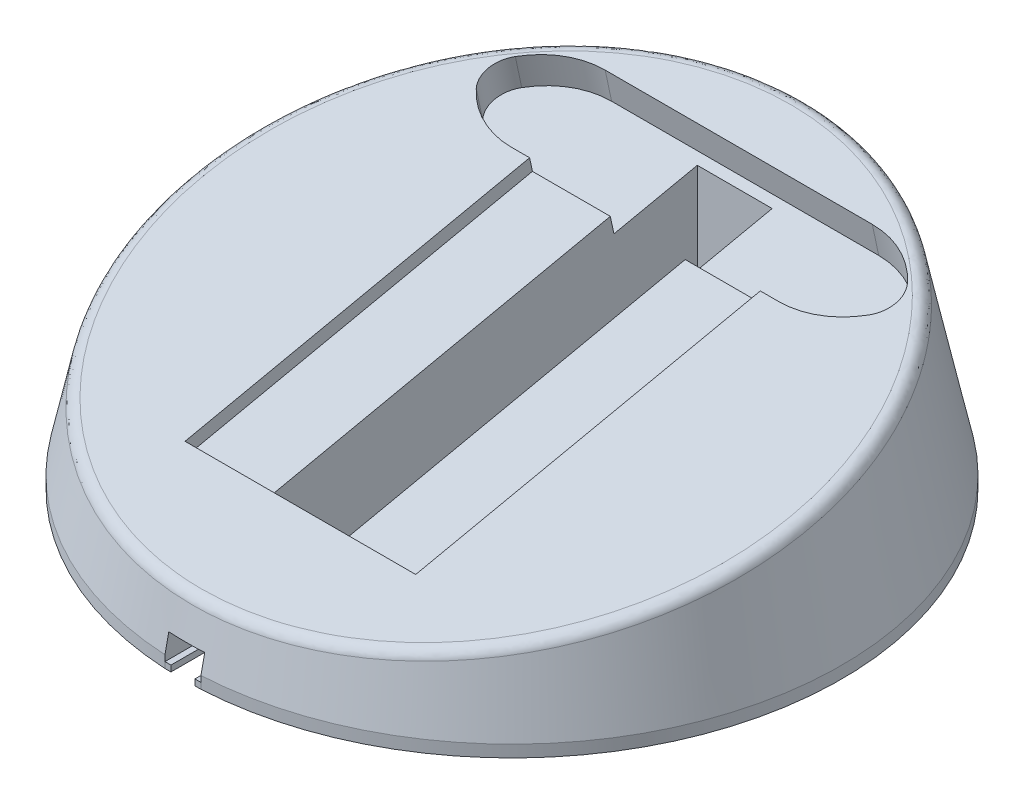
from build123d import *

# Parameters (mm, degrees)
SKETCH1_R               = 55
BOSS_EXTRUDE1_DEPTH     = 35
BOSS_EXTRUDE1_TAPER     = 12
SPLIT1_SURFACE_1_BACK   = 160.452
SPLIT1_SURFACE_1_DEPTH  = 320.904
FILLET2_R               = 2
SKETCH4_R               = 55
BOSS_EXTRUDE2_DEPTH     = 2
CUT_EXTRUDE9_DEPTH      = 84.496475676
CUT_EXTRUDE9_DEPTH_BACK = 84.496475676
CUT_EXTRUDE10_DEPTH     = 19.25
CUT_EXTRUDE11_DEPTH     = 5.15
CUT_EXTRUDE15_DEPTH     = 3
SKETCH77_R              = 6.6
CUT_EXTRUDE18_DEPTH     = 2.5
BOSS_EXTRUDE4_DEPTH     = 1
FILLET4_R               = 1


with BuildPart() as part:
    # Sketch1 → Boss-Extrude1 (new body)
    with BuildSketch(Plane(origin=(0, 0, 0), x_dir=(1, 0, 0), z_dir=(0, 1, 0))):
        Circle(SKETCH1_R)
    extrude(amount=BOSS_EXTRUDE1_DEPTH, taper=BOSS_EXTRUDE1_TAPER)

    # Split1: cut with a surface, the side it looks to stays
    # Split1 surface: a surface, the sketch's curves swept straight by 320.904 mm
    with BuildLine(Plane(origin=(0, 0, 0), x_dir=(0, 0, -1), z_dir=(1, 0, 0)).offset(-SPLIT1_SURFACE_1_BACK), mode=Mode.PRIVATE) as split1_surface_1_path:
        Line((55.112150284, 32.143260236), (-53.054751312, 9.151675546))
    split1_surface_1 = Shell.extrude(split1_surface_1_path.wire(), (1 * SPLIT1_SURFACE_1_DEPTH, 0 * SPLIT1_SURFACE_1_DEPTH, 0 * SPLIT1_SURFACE_1_DEPTH))
    split(bisect_by=split1_surface_1, keep=Keep.TOP)

    # Fillet2
    fillet2_edges = [part.edges().sort_by_distance(p)[0] for p in [
        (-36.868646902, 27.349273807, -32.558217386),
    ]]
    fillet(fillet2_edges, radius=FILLET2_R)

    # Sketch4 → Boss-Extrude2 (add)
    with BuildSketch(Plane.XZ):
        with Locations(Location((0, 0, 0), (0, 0, 270))):
            Circle(SKETCH4_R)
    extrude(amount=BOSS_EXTRUDE2_DEPTH)

    # Sketch16 → Cut-Extrude9 (cut, two sides: drawn at the far end of the back side and taken through both)
    with BuildSketch(Plane(origin=(0, 0, 0), x_dir=(1, 0, 0), z_dir=(0, 1, 0)).offset(-CUT_EXTRUDE9_DEPTH_BACK)):
        Polygon((0, 37.179856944), (-6.25, 37.179856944), (-6.25, -35.320143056), (0, -35.320143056), (6.25, -35.320143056), (6.25, 37.179856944), align=None)
    extrude(amount=CUT_EXTRUDE9_DEPTH + CUT_EXTRUDE9_DEPTH_BACK, mode=Mode.SUBTRACT)

    # Sketch17 → Cut-Extrude10 (cut, symmetric)
    with BuildSketch(Plane(origin=(0, 0, 0), x_dir=(0, 0, -1), z_dir=(1, 0, 0))):
        Polygon((22.664033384, 22.945933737), (22.19623208, 25.146765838), (-35.320143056, 12.9212829), (-35.320143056, 10.621016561), align=None)
    extrude(amount=CUT_EXTRUDE10_DEPTH, both=True, mode=Mode.SUBTRACT)

    # Sketch49 → Cut-Extrude11 (cut)
    with BuildSketch(Plane(origin=(0, 19.54572931, 4.154573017), x_dir=(1, 0, 0), z_dir=(0, 0.9781476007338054, 0.20791169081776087))):
        with BuildLine():
            Line((-22.291796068, 26.939497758), (22.291796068, 26.939497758))
            ThreePointArc((22.291796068, 26.939497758), (28.007272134, 28.15930475), (32.726779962, 31.606164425))
            ThreePointArc((32.726779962, 31.606164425), (34, 34.939497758), (32.726779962, 38.272831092))
            ThreePointArc((32.726779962, 38.272831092), (28.007272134, 41.719690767), (22.291796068, 42.939497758))
            Line((22.291796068, 42.939497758), (-22.291796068, 42.939497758))
            ThreePointArc((-22.291796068, 42.939497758), (-28.007272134, 41.719690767), (-32.726779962, 38.272831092))
            ThreePointArc((-32.726779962, 38.272831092), (-34, 34.939497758), (-32.726779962, 31.606164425))
            ThreePointArc((-32.726779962, 31.606164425), (-28.007272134, 28.15930475), (-22.291796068, 26.939497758))
        make_face()
    extrude(amount=-CUT_EXTRUDE11_DEPTH, mode=Mode.SUBTRACT)

    # Sketch73 → Cut-Extrude15 (cut, symmetric)
    with BuildSketch(Plane(origin=(0, 0, 0), x_dir=(0, 0, -1), z_dir=(1, 0, 0))):
        Polygon((-35.320143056, 8), (-37.320143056, 8), (-50, 3), (-55, 3), (-55, -2), (-35.320143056, -2), align=None)
    extrude(amount=CUT_EXTRUDE15_DEPTH, both=True, mode=Mode.SUBTRACT)

    # Sketch77 → Cut-Extrude18 (cut)
    with BuildSketch(Plane.XZ.offset(2)):
        with Locations(Location((-15.732926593, -43.225860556, 0), (0, 0, 270))):
            Circle(SKETCH77_R)
        with Locations(Location((-35.238044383, 29.568230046, 0), (0, 0, 270))):
            Circle(SKETCH77_R)
    cut_extrude18 = extrude(amount=-CUT_EXTRUDE18_DEPTH, mode=Mode.SUBTRACT)

    # Sketch79 → Boss-Extrude4 (add)
    with BuildSketch(Plane.XZ.offset(2)):
        Polygon((-3, 54.918120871), (-2, 54.918120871), (-2, 44.918120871), (-3, 43.918120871), align=None)
    boss_extrude4 = extrude(amount=-BOSS_EXTRUDE4_DEPTH)

    # Mirror2: Cut-Extrude18 across plane
    add(cut_extrude18.mirror(Plane(origin=(0, 0, 0), x_dir=(0, 0, 1), z_dir=(1, 0, 0))), mode=Mode.SUBTRACT)

    # Mirror3: Boss-Extrude4 across plane
    add(boss_extrude4.mirror(Plane(origin=(0, 0, 0), x_dir=(0, 0, 1), z_dir=(1, 0, 0))))

    # Fillet4
    fillet4_edges = [part.edges().sort_by_distance(p)[0] for p in [
        (-3, -1.5, 43.918120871),
        (-2, -1.5, 44.918120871),
        (3, -1.5, 43.918120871),
        (2, -1.5, 44.918120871),
    ]]
    fillet(fillet4_edges, radius=FILLET4_R)


solid = part.part
